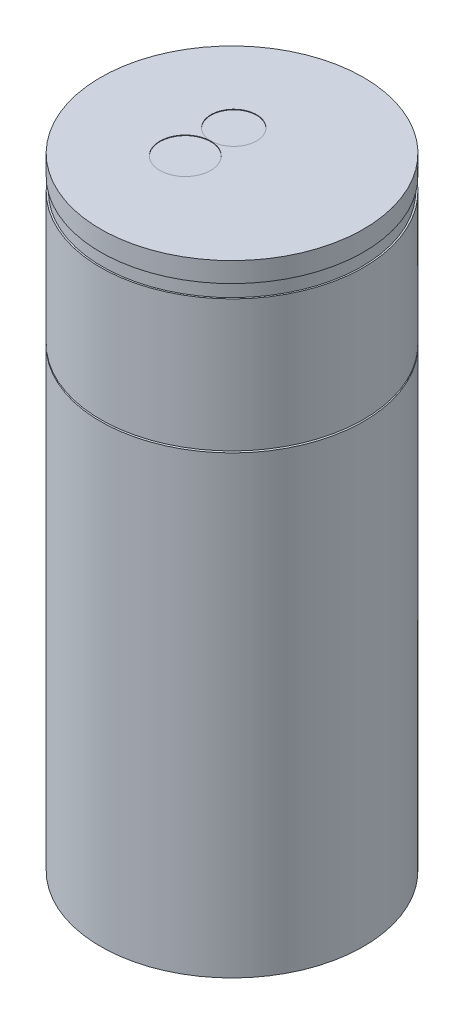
from build123d import *

# Parameters (mm, degrees)
SKETCH2_R          = 5.461
SKETCH2_R_2        = 6.096
CUT_EXTRUDE1_DEPTH = 0.127


with BuildPart() as part:
    # Sketch1 → Revolve1 (revolve)
    with BuildSketch(Plane.XY, mode=Mode.PRIVATE) as revolve1_sk:
        Polygon((0, 148.844), (-31.496, 148.844), (-31.496, 144.0688), (-31.115, 144.0688), (-31.115, 140.8938), (-31.496, 140.8938), (-31.496, 109.347), (-25.146, 109.347), (-25.146, 108.9406), (-31.496, 108.9406), (-31.496, 0), (0, 0), align=None)
    revolve(revolve1_sk.sketch.rotate(Axis((0, -34.593167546, 0), (0, 1, 0)), 270), axis=Axis((0, -34.593167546, 0), (0, 1, 0)))

    # Sketch2 → Cut-Extrude1 (cut)
    with BuildSketch(Plane(origin=(0, 148.844, 0), x_dir=(1, 0, 0), z_dir=(0, 1, 0))):
        with Locations(Location((-5.08, 5.4864, 0), (0, 0, 270))):
            Circle(SKETCH2_R)
        with Locations(Location((-5.08, -6.1214, 0), (0, 0, 270))):
            Circle(SKETCH2_R_2)
    extrude(amount=-CUT_EXTRUDE1_DEPTH, mode=Mode.SUBTRACT)


solid = part.part
